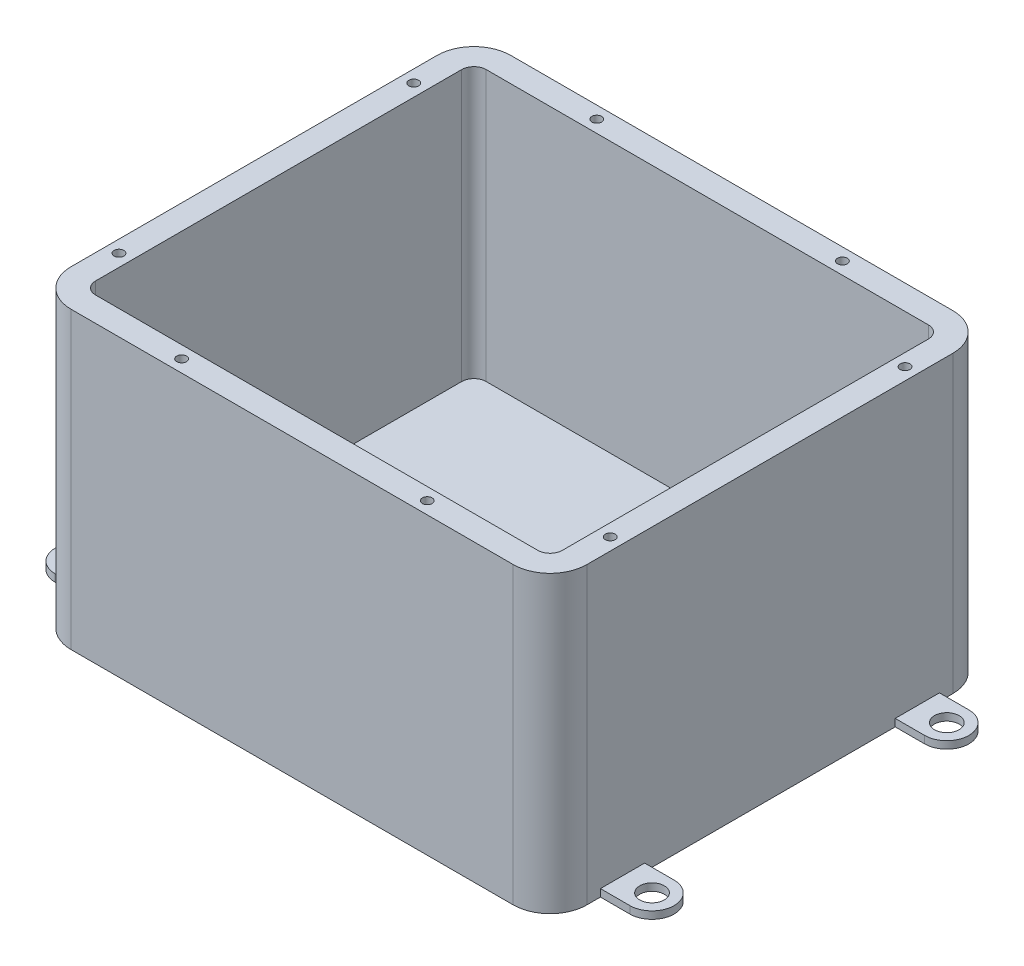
ISO-10303-21;
HEADER;
FILE_DESCRIPTION(('STEP AP214'),'2;1');
FILE_NAME('part.step','',(''),(''),'','','');
FILE_SCHEMA(('AUTOMOTIVE_DESIGN { 1 0 10303 214 1 1 1 1 }'));
ENDSEC;
DATA;
#1=APPLICATION_CONTEXT('core data for automotive mechanical design processes');
#2=APPLICATION_PROTOCOL_DEFINITION('international standard','automotive_design',2000,#1);
#3=PRODUCT_CONTEXT('',#1,'mechanical');
#4=PRODUCT('Part','Part','',(#3));
#5=PRODUCT_RELATED_PRODUCT_CATEGORY('part','',(#4));
#6=PRODUCT_DEFINITION_FORMATION('','',#4);
#7=PRODUCT_DEFINITION_CONTEXT('part definition',#1,'design');
#8=PRODUCT_DEFINITION('design','',#6,#7);
#9=PRODUCT_DEFINITION_SHAPE('','',#8);
#10=(LENGTH_UNIT() NAMED_UNIT(*) SI_UNIT(.MILLI.,.METRE.));
#11=(NAMED_UNIT(*) PLANE_ANGLE_UNIT() SI_UNIT($,.RADIAN.));
#12=(NAMED_UNIT(*) SI_UNIT($,.STERADIAN.) SOLID_ANGLE_UNIT());
#13=UNCERTAINTY_MEASURE_WITH_UNIT(LENGTH_MEASURE(1.E-05),#10,'distance_accuracy_value','');
#14=(GEOMETRIC_REPRESENTATION_CONTEXT(3) GLOBAL_UNCERTAINTY_ASSIGNED_CONTEXT((#13)) GLOBAL_UNIT_ASSIGNED_CONTEXT((#10,
#11,#12)) REPRESENTATION_CONTEXT('',''));
#15=CARTESIAN_POINT('',(0.,0.,0.));
#16=DIRECTION('',(0.,0.,1.));
#17=DIRECTION('',(1.,0.,0.));
#18=AXIS2_PLACEMENT_3D('',#15,#16,#17);
#19=CARTESIAN_POINT('',(-90.,225.,74.5));
#20=DIRECTION('',(0.,-1.,0.));
#21=DIRECTION('',(0.,0.,-1.));
#22=AXIS2_PLACEMENT_3D('',#19,#20,#21);
#23=CYLINDRICAL_SURFACE('',#22,5.);
#24=DIRECTION('',(0.,-1.,0.));
#25=VECTOR('',#24,1.);
#26=CARTESIAN_POINT('',(-95.,225.,74.5));
#27=LINE('',#26,#25);
#28=CARTESIAN_POINT('',(-95.,120.,74.5));
#29=VERTEX_POINT('',#28);
#30=CARTESIAN_POINT('',(-95.,10.,74.5));
#31=VERTEX_POINT('',#30);
#32=EDGE_CURVE('E304',#29,#31,#27,.T.);
#33=ORIENTED_EDGE('',*,*,#32,.F.);
#34=CARTESIAN_POINT('',(-90.,120.,74.5));
#35=DIRECTION('',(0.,1.,0.));
#36=DIRECTION('',(0.,0.,1.));
#37=AXIS2_PLACEMENT_3D('',#34,#35,#36);
#38=CIRCLE('',#37,5.);
#39=CARTESIAN_POINT('',(-90.,120.,79.5));
#40=VERTEX_POINT('',#39);
#41=EDGE_CURVE('E251',#29,#40,#38,.T.);
#42=ORIENTED_EDGE('',*,*,#41,.T.);
#43=DIRECTION('',(0.,1.,0.));
#44=VECTOR('',#43,1.);
#45=CARTESIAN_POINT('',(-90.,225.,79.5));
#46=LINE('',#45,#44);
#47=CARTESIAN_POINT('',(-90.,10.,79.5));
#48=VERTEX_POINT('',#47);
#49=EDGE_CURVE('E297',#40,#48,#46,.F.);
#50=ORIENTED_EDGE('',*,*,#49,.T.);
#51=CARTESIAN_POINT('',(-90.,10.,74.5));
#52=DIRECTION('',(0.,1.,0.));
#53=DIRECTION('',(0.,0.,1.));
#54=AXIS2_PLACEMENT_3D('',#51,#52,#53);
#55=CIRCLE('',#54,5.);
#56=EDGE_CURVE('E306',#31,#48,#55,.T.);
#57=ORIENTED_EDGE('',*,*,#56,.F.);
#58=EDGE_LOOP('',(#33,#42,#50,#57));
#59=FACE_BOUND('',#58,.T.);
#60=ADVANCED_FACE('F37',(#59),#23,.F.);
#61=CARTESIAN_POINT('',(-90.,225.,79.5));
#62=DIRECTION('',(0.,0.,-1.));
#63=DIRECTION('',(-1.,0.,0.));
#64=AXIS2_PLACEMENT_3D('',#61,#62,#63);
#65=PLANE('',#64);
#66=ORIENTED_EDGE('',*,*,#49,.F.);
#67=DIRECTION('',(1.,0.,0.));
#68=VECTOR('',#67,1.);
#69=CARTESIAN_POINT('',(-90.,120.,79.5));
#70=LINE('',#69,#68);
#71=CARTESIAN_POINT('',(90.,120.,79.5));
#72=VERTEX_POINT('',#71);
#73=EDGE_CURVE('E510',#40,#72,#70,.T.);
#74=ORIENTED_EDGE('',*,*,#73,.T.);
#75=DIRECTION('',(0.,-1.,0.));
#76=VECTOR('',#75,1.);
#77=CARTESIAN_POINT('',(90.,225.,79.5));
#78=LINE('',#77,#76);
#79=CARTESIAN_POINT('',(90.,10.,79.5));
#80=VERTEX_POINT('',#79);
#81=EDGE_CURVE('E294',#72,#80,#78,.T.);
#82=ORIENTED_EDGE('',*,*,#81,.T.);
#83=DIRECTION('',(1.,0.,0.));
#84=VECTOR('',#83,1.);
#85=CARTESIAN_POINT('',(-90.,10.,79.5));
#86=LINE('',#85,#84);
#87=EDGE_CURVE('E305',#48,#80,#86,.T.);
#88=ORIENTED_EDGE('',*,*,#87,.F.);
#89=EDGE_LOOP('',(#66,#74,#82,#88));
#90=FACE_BOUND('',#89,.T.);
#91=ADVANCED_FACE('F599',(#90),#65,.T.);
#92=CARTESIAN_POINT('',(90.,225.,74.5));
#93=DIRECTION('',(0.,-1.,0.));
#94=DIRECTION('',(0.,0.,-1.));
#95=AXIS2_PLACEMENT_3D('',#92,#93,#94);
#96=CYLINDRICAL_SURFACE('',#95,5.);
#97=ORIENTED_EDGE('',*,*,#81,.F.);
#98=CARTESIAN_POINT('',(90.,120.,74.5));
#99=DIRECTION('',(0.,1.,0.));
#100=DIRECTION('',(0.,0.,1.));
#101=AXIS2_PLACEMENT_3D('',#98,#99,#100);
#102=CIRCLE('',#101,5.);
#103=CARTESIAN_POINT('',(95.,120.,74.5));
#104=VERTEX_POINT('',#103);
#105=EDGE_CURVE('E509',#72,#104,#102,.T.);
#106=ORIENTED_EDGE('',*,*,#105,.T.);
#107=DIRECTION('',(0.,1.,0.));
#108=VECTOR('',#107,1.);
#109=CARTESIAN_POINT('',(95.,225.,74.5));
#110=LINE('',#109,#108);
#111=CARTESIAN_POINT('',(95.,10.,74.5));
#112=VERTEX_POINT('',#111);
#113=EDGE_CURVE('E289',#104,#112,#110,.F.);
#114=ORIENTED_EDGE('',*,*,#113,.T.);
#115=CARTESIAN_POINT('',(90.,10.,74.5));
#116=DIRECTION('',(0.,1.,0.));
#117=DIRECTION('',(0.,0.,1.));
#118=AXIS2_PLACEMENT_3D('',#115,#116,#117);
#119=CIRCLE('',#118,5.);
#120=EDGE_CURVE('E300',#80,#112,#119,.T.);
#121=ORIENTED_EDGE('',*,*,#120,.F.);
#122=EDGE_LOOP('',(#97,#106,#114,#121));
#123=FACE_BOUND('',#122,.T.);
#124=ADVANCED_FACE('F603',(#123),#96,.F.);
#125=CARTESIAN_POINT('',(95.,225.,74.5));
#126=DIRECTION('',(-1.,0.,0.));
#127=DIRECTION('',(0.,0.,1.));
#128=AXIS2_PLACEMENT_3D('',#125,#126,#127);
#129=PLANE('',#128);
#130=ORIENTED_EDGE('',*,*,#113,.F.);
#131=DIRECTION('',(0.,0.,-1.));
#132=VECTOR('',#131,1.);
#133=CARTESIAN_POINT('',(95.,120.,74.5));
#134=LINE('',#133,#132);
#135=CARTESIAN_POINT('',(95.,120.,-74.5));
#136=VERTEX_POINT('',#135);
#137=EDGE_CURVE('E514',#104,#136,#134,.T.);
#138=ORIENTED_EDGE('',*,*,#137,.T.);
#139=DIRECTION('',(0.,-1.,0.));
#140=VECTOR('',#139,1.);
#141=CARTESIAN_POINT('',(95.,225.,-74.5));
#142=LINE('',#141,#140);
#143=CARTESIAN_POINT('',(95.,10.,-74.5));
#144=VERTEX_POINT('',#143);
#145=EDGE_CURVE('E281',#136,#144,#142,.T.);
#146=ORIENTED_EDGE('',*,*,#145,.T.);
#147=DIRECTION('',(0.,0.,-1.));
#148=VECTOR('',#147,1.);
#149=CARTESIAN_POINT('',(95.,10.,74.5));
#150=LINE('',#149,#148);
#151=EDGE_CURVE('E292',#112,#144,#150,.T.);
#152=ORIENTED_EDGE('',*,*,#151,.F.);
#153=EDGE_LOOP('',(#130,#138,#146,#152));
#154=FACE_BOUND('',#153,.T.);
#155=ADVANCED_FACE('F613',(#154),#129,.T.);
#156=CARTESIAN_POINT('',(90.,225.,-74.5));
#157=DIRECTION('',(0.,-1.,0.));
#158=DIRECTION('',(0.,0.,-1.));
#159=AXIS2_PLACEMENT_3D('',#156,#157,#158);
#160=CYLINDRICAL_SURFACE('',#159,5.);
#161=ORIENTED_EDGE('',*,*,#145,.F.);
#162=CARTESIAN_POINT('',(90.,120.,-74.5));
#163=DIRECTION('',(0.,1.,0.));
#164=DIRECTION('',(0.,0.,1.));
#165=AXIS2_PLACEMENT_3D('',#162,#163,#164);
#166=CIRCLE('',#165,5.);
#167=CARTESIAN_POINT('',(90.,120.,-79.5));
#168=VERTEX_POINT('',#167);
#169=EDGE_CURVE('E517',#136,#168,#166,.T.);
#170=ORIENTED_EDGE('',*,*,#169,.T.);
#171=DIRECTION('',(0.,1.,0.));
#172=VECTOR('',#171,1.);
#173=CARTESIAN_POINT('',(90.,225.,-79.5));
#174=LINE('',#173,#172);
#175=CARTESIAN_POINT('',(90.,10.,-79.5));
#176=VERTEX_POINT('',#175);
#177=EDGE_CURVE('E278',#168,#176,#174,.F.);
#178=ORIENTED_EDGE('',*,*,#177,.T.);
#179=CARTESIAN_POINT('',(90.,10.,-74.5));
#180=DIRECTION('',(0.,1.,0.));
#181=DIRECTION('',(0.,0.,1.));
#182=AXIS2_PLACEMENT_3D('',#179,#180,#181);
#183=CIRCLE('',#182,5.);
#184=EDGE_CURVE('E290',#144,#176,#183,.T.);
#185=ORIENTED_EDGE('',*,*,#184,.F.);
#186=EDGE_LOOP('',(#161,#170,#178,#185));
#187=FACE_BOUND('',#186,.T.);
#188=ADVANCED_FACE('F616',(#187),#160,.F.);
#189=CARTESIAN_POINT('',(-90.,225.,-79.5));
#190=DIRECTION('',(0.,0.,1.));
#191=DIRECTION('',(1.,0.,0.));
#192=AXIS2_PLACEMENT_3D('',#189,#190,#191);
#193=PLANE('',#192);
#194=ORIENTED_EDGE('',*,*,#177,.F.);
#195=DIRECTION('',(-1.,0.,0.));
#196=VECTOR('',#195,1.);
#197=CARTESIAN_POINT('',(-90.,120.,-79.5));
#198=LINE('',#197,#196);
#199=CARTESIAN_POINT('',(-90.,120.,-79.5));
#200=VERTEX_POINT('',#199);
#201=EDGE_CURVE('E265',#168,#200,#198,.T.);
#202=ORIENTED_EDGE('',*,*,#201,.T.);
#203=DIRECTION('',(0.,-1.,0.));
#204=VECTOR('',#203,1.);
#205=CARTESIAN_POINT('',(-90.,225.,-79.5));
#206=LINE('',#205,#204);
#207=CARTESIAN_POINT('',(-90.,10.,-79.5));
#208=VERTEX_POINT('',#207);
#209=EDGE_CURVE('E262',#200,#208,#206,.T.);
#210=ORIENTED_EDGE('',*,*,#209,.T.);
#211=DIRECTION('',(-1.,0.,0.));
#212=VECTOR('',#211,1.);
#213=CARTESIAN_POINT('',(-90.,10.,-79.5));
#214=LINE('',#213,#212);
#215=EDGE_CURVE('E284',#176,#208,#214,.T.);
#216=ORIENTED_EDGE('',*,*,#215,.F.);
#217=EDGE_LOOP('',(#194,#202,#210,#216));
#218=FACE_BOUND('',#217,.T.);
#219=ADVANCED_FACE('F625',(#218),#193,.T.);
#220=CARTESIAN_POINT('',(-90.,225.,-74.5));
#221=DIRECTION('',(0.,-1.,0.));
#222=DIRECTION('',(0.,0.,-1.));
#223=AXIS2_PLACEMENT_3D('',#220,#221,#222);
#224=CYLINDRICAL_SURFACE('',#223,5.);
#225=ORIENTED_EDGE('',*,*,#209,.F.);
#226=CARTESIAN_POINT('',(-90.,120.,-74.5));
#227=DIRECTION('',(0.,1.,0.));
#228=DIRECTION('',(0.,0.,1.));
#229=AXIS2_PLACEMENT_3D('',#226,#227,#228);
#230=CIRCLE('',#229,5.);
#231=CARTESIAN_POINT('',(-95.,120.,-74.5));
#232=VERTEX_POINT('',#231);
#233=EDGE_CURVE('E252',#200,#232,#230,.T.);
#234=ORIENTED_EDGE('',*,*,#233,.T.);
#235=DIRECTION('',(0.,1.,0.));
#236=VECTOR('',#235,1.);
#237=CARTESIAN_POINT('',(-95.,225.,-74.5));
#238=LINE('',#237,#236);
#239=CARTESIAN_POINT('',(-95.,10.,-74.5));
#240=VERTEX_POINT('',#239);
#241=EDGE_CURVE('E48',#232,#240,#238,.F.);
#242=ORIENTED_EDGE('',*,*,#241,.T.);
#243=CARTESIAN_POINT('',(-90.,10.,-74.5));
#244=DIRECTION('',(0.,1.,0.));
#245=DIRECTION('',(0.,0.,1.));
#246=AXIS2_PLACEMENT_3D('',#243,#244,#245);
#247=CIRCLE('',#246,5.);
#248=EDGE_CURVE('E279',#208,#240,#247,.T.);
#249=ORIENTED_EDGE('',*,*,#248,.F.);
#250=EDGE_LOOP('',(#225,#234,#242,#249));
#251=FACE_BOUND('',#250,.T.);
#252=ADVANCED_FACE('F258',(#251),#224,.F.);
#253=CARTESIAN_POINT('',(-95.,225.,74.5));
#254=DIRECTION('',(1.,0.,0.));
#255=DIRECTION('',(0.,0.,-1.));
#256=AXIS2_PLACEMENT_3D('',#253,#254,#255);
#257=PLANE('',#256);
#258=ORIENTED_EDGE('',*,*,#241,.F.);
#259=DIRECTION('',(0.,0.,1.));
#260=VECTOR('',#259,1.);
#261=CARTESIAN_POINT('',(-95.,120.,74.5));
#262=LINE('',#261,#260);
#263=EDGE_CURVE('E12',#232,#29,#262,.T.);
#264=ORIENTED_EDGE('',*,*,#263,.T.);
#265=ORIENTED_EDGE('',*,*,#32,.T.);
#266=DIRECTION('',(0.,0.,1.));
#267=VECTOR('',#266,1.);
#268=CARTESIAN_POINT('',(-95.,10.,74.5));
#269=LINE('',#268,#267);
#270=EDGE_CURVE('E269',#240,#31,#269,.T.);
#271=ORIENTED_EDGE('',*,*,#270,.F.);
#272=EDGE_LOOP('',(#258,#264,#265,#271));
#273=FACE_BOUND('',#272,.T.);
#274=ADVANCED_FACE('F267',(#273),#257,.T.);
#275=CARTESIAN_POINT('',(-90.,10.,74.5));
#276=DIRECTION('',(0.,1.,0.));
#277=DIRECTION('',(0.,0.,1.));
#278=AXIS2_PLACEMENT_3D('',#275,#276,#277);
#279=PLANE('',#278);
#280=ORIENTED_EDGE('',*,*,#56,.T.);
#281=ORIENTED_EDGE('',*,*,#87,.T.);
#282=ORIENTED_EDGE('',*,*,#120,.T.);
#283=ORIENTED_EDGE('',*,*,#151,.T.);
#284=ORIENTED_EDGE('',*,*,#184,.T.);
#285=ORIENTED_EDGE('',*,*,#215,.T.);
#286=ORIENTED_EDGE('',*,*,#248,.T.);
#287=ORIENTED_EDGE('',*,*,#270,.T.);
#288=EDGE_LOOP('',(#280,#281,#282,#283,#284,#285,#286,#287));
#289=FACE_BOUND('',#288,.T.);
#290=ADVANCED_FACE('F45',(#289),#279,.T.);
#291=CARTESIAN_POINT('',(0.,120.,0.));
#292=DIRECTION('',(0.,1.,0.));
#293=DIRECTION('',(0.,0.,1.));
#294=AXIS2_PLACEMENT_3D('',#291,#292,#293);
#295=PLANE('',#294);
#296=CARTESIAN_POINT('',(-100.,120.,-60.));
#297=DIRECTION('',(0.,1.,0.));
#298=DIRECTION('',(0.,0.,1.));
#299=AXIS2_PLACEMENT_3D('',#296,#297,#298);
#300=CIRCLE('',#299,2.);
#301=CARTESIAN_POINT('',(-100.,120.,-58.));
#302=VERTEX_POINT('',#301);
#303=EDGE_CURVE('E543',#302,#302,#300,.T.);
#304=ORIENTED_EDGE('',*,*,#303,.F.);
#305=EDGE_LOOP('',(#304));
#306=FACE_BOUND('',#305,.T.);
#307=CARTESIAN_POINT('',(50.,120.,84.5));
#308=DIRECTION('',(0.,1.,0.));
#309=DIRECTION('',(0.,0.,1.));
#310=AXIS2_PLACEMENT_3D('',#307,#308,#309);
#311=CIRCLE('',#310,2.);
#312=CARTESIAN_POINT('',(50.,120.,86.5));
#313=VERTEX_POINT('',#312);
#314=EDGE_CURVE('E529',#313,#313,#311,.T.);
#315=ORIENTED_EDGE('',*,*,#314,.F.);
#316=EDGE_LOOP('',(#315));
#317=FACE_BOUND('',#316,.T.);
#318=CARTESIAN_POINT('',(-50.,120.,84.5));
#319=DIRECTION('',(0.,1.,0.));
#320=DIRECTION('',(0.,0.,-1.));
#321=AXIS2_PLACEMENT_3D('',#318,#319,#320);
#322=CIRCLE('',#321,2.);
#323=CARTESIAN_POINT('',(-50.,120.,82.5));
#324=VERTEX_POINT('',#323);
#325=EDGE_CURVE('E528',#324,#324,#322,.T.);
#326=ORIENTED_EDGE('',*,*,#325,.F.);
#327=EDGE_LOOP('',(#326));
#328=FACE_BOUND('',#327,.T.);
#329=CARTESIAN_POINT('',(50.,120.,-84.5));
#330=DIRECTION('',(0.,1.,0.));
#331=DIRECTION('',(0.,0.,-1.));
#332=AXIS2_PLACEMENT_3D('',#329,#330,#331);
#333=CIRCLE('',#332,2.);
#334=CARTESIAN_POINT('',(50.,120.,-86.5));
#335=VERTEX_POINT('',#334);
#336=EDGE_CURVE('E522',#335,#335,#333,.T.);
#337=ORIENTED_EDGE('',*,*,#336,.F.);
#338=EDGE_LOOP('',(#337));
#339=FACE_BOUND('',#338,.T.);
#340=CARTESIAN_POINT('',(-100.,120.,60.));
#341=DIRECTION('',(0.,1.,0.));
#342=DIRECTION('',(0.,0.,-1.));
#343=AXIS2_PLACEMENT_3D('',#340,#341,#342);
#344=CIRCLE('',#343,2.);
#345=CARTESIAN_POINT('',(-100.,120.,58.));
#346=VERTEX_POINT('',#345);
#347=EDGE_CURVE('E544',#346,#346,#344,.T.);
#348=ORIENTED_EDGE('',*,*,#347,.F.);
#349=EDGE_LOOP('',(#348));
#350=FACE_BOUND('',#349,.T.);
#351=CARTESIAN_POINT('',(100.,120.,60.));
#352=DIRECTION('',(0.,1.,0.));
#353=DIRECTION('',(0.,0.,1.));
#354=AXIS2_PLACEMENT_3D('',#351,#352,#353);
#355=CIRCLE('',#354,2.);
#356=CARTESIAN_POINT('',(100.,120.,62.));
#357=VERTEX_POINT('',#356);
#358=EDGE_CURVE('E559',#357,#357,#355,.T.);
#359=ORIENTED_EDGE('',*,*,#358,.F.);
#360=EDGE_LOOP('',(#359));
#361=FACE_BOUND('',#360,.T.);
#362=CARTESIAN_POINT('',(100.,120.,-60.));
#363=DIRECTION('',(0.,1.,0.));
#364=DIRECTION('',(0.,0.,-1.));
#365=AXIS2_PLACEMENT_3D('',#362,#363,#364);
#366=CIRCLE('',#365,2.);
#367=CARTESIAN_POINT('',(100.,120.,-62.));
#368=VERTEX_POINT('',#367);
#369=EDGE_CURVE('E551',#368,#368,#366,.T.);
#370=ORIENTED_EDGE('',*,*,#369,.F.);
#371=EDGE_LOOP('',(#370));
#372=FACE_BOUND('',#371,.T.);
#373=CARTESIAN_POINT('',(-50.,120.,-84.5));
#374=DIRECTION('',(0.,1.,0.));
#375=DIRECTION('',(0.,0.,1.));
#376=AXIS2_PLACEMENT_3D('',#373,#374,#375);
#377=CIRCLE('',#376,2.);
#378=CARTESIAN_POINT('',(-50.,120.,-82.5));
#379=VERTEX_POINT('',#378);
#380=EDGE_CURVE('E518',#379,#379,#377,.T.);
#381=ORIENTED_EDGE('',*,*,#380,.F.);
#382=EDGE_LOOP('',(#381));
#383=FACE_BOUND('',#382,.T.);
#384=ORIENTED_EDGE('',*,*,#41,.F.);
#385=ORIENTED_EDGE('',*,*,#263,.F.);
#386=ORIENTED_EDGE('',*,*,#233,.F.);
#387=ORIENTED_EDGE('',*,*,#201,.F.);
#388=ORIENTED_EDGE('',*,*,#169,.F.);
#389=ORIENTED_EDGE('',*,*,#137,.F.);
#390=ORIENTED_EDGE('',*,*,#105,.F.);
#391=ORIENTED_EDGE('',*,*,#73,.F.);
#392=EDGE_LOOP('',(#384,#385,#386,#387,#388,#389,#390,#391));
#393=FACE_BOUND('',#392,.T.);
#394=DIRECTION('',(0.,0.,1.));
#395=VECTOR('',#394,1.);
#396=CARTESIAN_POINT('',(-105.,120.,74.5));
#397=LINE('',#396,#395);
#398=CARTESIAN_POINT('',(-105.,120.,-74.5));
#399=VERTEX_POINT('',#398);
#400=CARTESIAN_POINT('',(-105.,120.,74.5));
#401=VERTEX_POINT('',#400);
#402=EDGE_CURVE('E494',#399,#401,#397,.T.);
#403=ORIENTED_EDGE('',*,*,#402,.T.);
#404=CARTESIAN_POINT('',(-90.,120.,74.5));
#405=DIRECTION('',(0.,1.,0.));
#406=DIRECTION('',(0.,0.,1.));
#407=AXIS2_PLACEMENT_3D('',#404,#405,#406);
#408=CIRCLE('',#407,15.);
#409=CARTESIAN_POINT('',(-90.,120.,89.5));
#410=VERTEX_POINT('',#409);
#411=EDGE_CURVE('E54',#401,#410,#408,.T.);
#412=ORIENTED_EDGE('',*,*,#411,.T.);
#413=DIRECTION('',(1.,0.,0.));
#414=VECTOR('',#413,1.);
#415=CARTESIAN_POINT('',(-90.,120.,89.5));
#416=LINE('',#415,#414);
#417=CARTESIAN_POINT('',(90.,120.,89.5));
#418=VERTEX_POINT('',#417);
#419=EDGE_CURVE('E64',#410,#418,#416,.T.);
#420=ORIENTED_EDGE('',*,*,#419,.T.);
#421=CARTESIAN_POINT('',(90.,120.,74.5));
#422=DIRECTION('',(0.,1.,0.));
#423=DIRECTION('',(0.,0.,1.));
#424=AXIS2_PLACEMENT_3D('',#421,#422,#423);
#425=CIRCLE('',#424,15.);
#426=CARTESIAN_POINT('',(105.,120.,74.5));
#427=VERTEX_POINT('',#426);
#428=EDGE_CURVE('E486',#418,#427,#425,.T.);
#429=ORIENTED_EDGE('',*,*,#428,.T.);
#430=DIRECTION('',(0.,0.,-1.));
#431=VECTOR('',#430,1.);
#432=CARTESIAN_POINT('',(105.,120.,74.5));
#433=LINE('',#432,#431);
#434=CARTESIAN_POINT('',(105.,120.,-74.5));
#435=VERTEX_POINT('',#434);
#436=EDGE_CURVE('E493',#427,#435,#433,.T.);
#437=ORIENTED_EDGE('',*,*,#436,.T.);
#438=CARTESIAN_POINT('',(90.,120.,-74.5));
#439=DIRECTION('',(0.,1.,0.));
#440=DIRECTION('',(0.,0.,1.));
#441=AXIS2_PLACEMENT_3D('',#438,#439,#440);
#442=CIRCLE('',#441,15.);
#443=CARTESIAN_POINT('',(90.,120.,-89.5));
#444=VERTEX_POINT('',#443);
#445=EDGE_CURVE('E500',#435,#444,#442,.T.);
#446=ORIENTED_EDGE('',*,*,#445,.T.);
#447=DIRECTION('',(-1.,0.,0.));
#448=VECTOR('',#447,1.);
#449=CARTESIAN_POINT('',(-90.,120.,-89.5));
#450=LINE('',#449,#448);
#451=CARTESIAN_POINT('',(-90.,120.,-89.5));
#452=VERTEX_POINT('',#451);
#453=EDGE_CURVE('E499',#444,#452,#450,.T.);
#454=ORIENTED_EDGE('',*,*,#453,.T.);
#455=CARTESIAN_POINT('',(-90.,120.,-74.5));
#456=DIRECTION('',(0.,1.,0.));
#457=DIRECTION('',(0.,0.,1.));
#458=AXIS2_PLACEMENT_3D('',#455,#456,#457);
#459=CIRCLE('',#458,15.);
#460=EDGE_CURVE('E503',#452,#399,#459,.T.);
#461=ORIENTED_EDGE('',*,*,#460,.T.);
#462=EDGE_LOOP('',(#403,#412,#420,#429,#437,#446,#454,#461));
#463=FACE_BOUND('',#462,.T.);
#464=ADVANCED_FACE('F248',(#306,#317,#328,#339,#350,#361,#372,#383,#393,#463),#295,.T.);
#465=CARTESIAN_POINT('',(105.,225.,74.5));
#466=DIRECTION('',(-1.,0.,0.));
#467=DIRECTION('',(0.,0.,1.));
#468=AXIS2_PLACEMENT_3D('',#465,#466,#467);
#469=PLANE('',#468);
#470=ORIENTED_EDGE('',*,*,#436,.F.);
#471=DIRECTION('',(0.,-1.,0.));
#472=VECTOR('',#471,1.);
#473=CARTESIAN_POINT('',(105.,225.,74.5));
#474=LINE('',#473,#472);
#475=CARTESIAN_POINT('',(105.,0.,74.5));
#476=VERTEX_POINT('',#475);
#477=EDGE_CURVE('E312',#427,#476,#474,.T.);
#478=ORIENTED_EDGE('',*,*,#477,.T.);
#479=DIRECTION('',(0.,0.,-1.));
#480=VECTOR('',#479,1.);
#481=CARTESIAN_POINT('',(105.,0.,74.5));
#482=LINE('',#481,#480);
#483=CARTESIAN_POINT('',(105.,0.,69.));
#484=VERTEX_POINT('',#483);
#485=EDGE_CURVE('E345',#476,#484,#482,.T.);
#486=ORIENTED_EDGE('',*,*,#485,.T.);
#487=DIRECTION('',(0.,-1.,0.));
#488=VECTOR('',#487,1.);
#489=CARTESIAN_POINT('',(105.,3.,69.));
#490=LINE('',#489,#488);
#491=CARTESIAN_POINT('',(105.,3.,69.));
#492=VERTEX_POINT('',#491);
#493=EDGE_CURVE('E449',#492,#484,#490,.T.);
#494=ORIENTED_EDGE('',*,*,#493,.F.);
#495=DIRECTION('',(0.,0.,1.));
#496=VECTOR('',#495,1.);
#497=CARTESIAN_POINT('',(105.,3.,51.));
#498=LINE('',#497,#496);
#499=CARTESIAN_POINT('',(105.,3.,51.));
#500=VERTEX_POINT('',#499);
#501=EDGE_CURVE('E436',#500,#492,#498,.T.);
#502=ORIENTED_EDGE('',*,*,#501,.F.);
#503=DIRECTION('',(0.,-1.,0.));
#504=VECTOR('',#503,1.);
#505=CARTESIAN_POINT('',(105.,3.,51.));
#506=LINE('',#505,#504);
#507=CARTESIAN_POINT('',(105.,0.,51.));
#508=VERTEX_POINT('',#507);
#509=EDGE_CURVE('E448',#500,#508,#506,.T.);
#510=ORIENTED_EDGE('',*,*,#509,.T.);
#511=CARTESIAN_POINT('',(105.,0.,-51.));
#512=VERTEX_POINT('',#511);
#513=EDGE_CURVE('E343',#508,#512,#482,.T.);
#514=ORIENTED_EDGE('',*,*,#513,.T.);
#515=DIRECTION('',(0.,-1.,0.));
#516=VECTOR('',#515,1.);
#517=CARTESIAN_POINT('',(105.,3.,-51.));
#518=LINE('',#517,#516);
#519=CARTESIAN_POINT('',(105.,3.,-51.));
#520=VERTEX_POINT('',#519);
#521=EDGE_CURVE('E415',#520,#512,#518,.T.);
#522=ORIENTED_EDGE('',*,*,#521,.F.);
#523=DIRECTION('',(0.,0.,1.));
#524=VECTOR('',#523,1.);
#525=CARTESIAN_POINT('',(105.,3.,-51.));
#526=LINE('',#525,#524);
#527=CARTESIAN_POINT('',(105.,3.,-69.));
#528=VERTEX_POINT('',#527);
#529=EDGE_CURVE('E405',#528,#520,#526,.T.);
#530=ORIENTED_EDGE('',*,*,#529,.F.);
#531=DIRECTION('',(0.,-1.,0.));
#532=VECTOR('',#531,1.);
#533=CARTESIAN_POINT('',(105.,3.,-69.));
#534=LINE('',#533,#532);
#535=CARTESIAN_POINT('',(105.,0.,-69.));
#536=VERTEX_POINT('',#535);
#537=EDGE_CURVE('E416',#528,#536,#534,.T.);
#538=ORIENTED_EDGE('',*,*,#537,.T.);
#539=CARTESIAN_POINT('',(105.,0.,-74.5));
#540=VERTEX_POINT('',#539);
#541=EDGE_CURVE('E348',#536,#540,#482,.T.);
#542=ORIENTED_EDGE('',*,*,#541,.T.);
#543=DIRECTION('',(0.,-1.,0.));
#544=VECTOR('',#543,1.);
#545=CARTESIAN_POINT('',(105.,225.,-74.5));
#546=LINE('',#545,#544);
#547=EDGE_CURVE('E317',#435,#540,#546,.T.);
#548=ORIENTED_EDGE('',*,*,#547,.F.);
#549=EDGE_LOOP('',(#470,#478,#486,#494,#502,#510,#514,#522,#530,#538,#542,#548));
#550=FACE_BOUND('',#549,.T.);
#551=ADVANCED_FACE('F575',(#550),#469,.F.);
#552=CARTESIAN_POINT('',(-105.,225.,74.5));
#553=DIRECTION('',(1.,0.,0.));
#554=DIRECTION('',(0.,0.,-1.));
#555=AXIS2_PLACEMENT_3D('',#552,#553,#554);
#556=PLANE('',#555);
#557=ORIENTED_EDGE('',*,*,#402,.F.);
#558=DIRECTION('',(0.,-1.,0.));
#559=VECTOR('',#558,1.);
#560=CARTESIAN_POINT('',(-105.,225.,-74.5));
#561=LINE('',#560,#559);
#562=CARTESIAN_POINT('',(-105.,0.,-74.5));
#563=VERTEX_POINT('',#562);
#564=EDGE_CURVE('E321',#399,#563,#561,.T.);
#565=ORIENTED_EDGE('',*,*,#564,.T.);
#566=DIRECTION('',(0.,0.,1.));
#567=VECTOR('',#566,1.);
#568=CARTESIAN_POINT('',(-105.,0.,74.5));
#569=LINE('',#568,#567);
#570=CARTESIAN_POINT('',(-105.,0.,-69.));
#571=VERTEX_POINT('',#570);
#572=EDGE_CURVE('E327',#563,#571,#569,.T.);
#573=ORIENTED_EDGE('',*,*,#572,.T.);
#574=DIRECTION('',(0.,-1.,0.));
#575=VECTOR('',#574,1.);
#576=CARTESIAN_POINT('',(-105.,3.,-69.));
#577=LINE('',#576,#575);
#578=CARTESIAN_POINT('',(-105.,3.,-69.));
#579=VERTEX_POINT('',#578);
#580=EDGE_CURVE('E359',#579,#571,#577,.T.);
#581=ORIENTED_EDGE('',*,*,#580,.F.);
#582=DIRECTION('',(0.,0.,-1.));
#583=VECTOR('',#582,1.);
#584=CARTESIAN_POINT('',(-105.,3.,-51.));
#585=LINE('',#584,#583);
#586=CARTESIAN_POINT('',(-105.,3.,-51.));
#587=VERTEX_POINT('',#586);
#588=EDGE_CURVE('E376',#587,#579,#585,.T.);
#589=ORIENTED_EDGE('',*,*,#588,.F.);
#590=DIRECTION('',(0.,-1.,0.));
#591=VECTOR('',#590,1.);
#592=CARTESIAN_POINT('',(-105.,3.,-51.));
#593=LINE('',#592,#591);
#594=CARTESIAN_POINT('',(-105.,0.,-51.));
#595=VERTEX_POINT('',#594);
#596=EDGE_CURVE('E357',#587,#595,#593,.T.);
#597=ORIENTED_EDGE('',*,*,#596,.T.);
#598=CARTESIAN_POINT('',(-105.,0.,51.));
#599=VERTEX_POINT('',#598);
#600=EDGE_CURVE('E331',#595,#599,#569,.T.);
#601=ORIENTED_EDGE('',*,*,#600,.T.);
#602=DIRECTION('',(0.,-1.,0.));
#603=VECTOR('',#602,1.);
#604=CARTESIAN_POINT('',(-105.,3.,51.));
#605=LINE('',#604,#603);
#606=CARTESIAN_POINT('',(-105.,3.,51.));
#607=VERTEX_POINT('',#606);
#608=EDGE_CURVE('E480',#607,#599,#605,.T.);
#609=ORIENTED_EDGE('',*,*,#608,.F.);
#610=DIRECTION('',(0.,0.,-1.));
#611=VECTOR('',#610,1.);
#612=CARTESIAN_POINT('',(-105.,3.,51.));
#613=LINE('',#612,#611);
#614=CARTESIAN_POINT('',(-105.,3.,69.));
#615=VERTEX_POINT('',#614);
#616=EDGE_CURVE('E470',#615,#607,#613,.T.);
#617=ORIENTED_EDGE('',*,*,#616,.F.);
#618=DIRECTION('',(0.,-1.,0.));
#619=VECTOR('',#618,1.);
#620=CARTESIAN_POINT('',(-105.,3.,69.));
#621=LINE('',#620,#619);
#622=CARTESIAN_POINT('',(-105.,0.,69.));
#623=VERTEX_POINT('',#622);
#624=EDGE_CURVE('E481',#615,#623,#621,.T.);
#625=ORIENTED_EDGE('',*,*,#624,.T.);
#626=CARTESIAN_POINT('',(-105.,0.,74.5));
#627=VERTEX_POINT('',#626);
#628=EDGE_CURVE('E335',#623,#627,#569,.T.);
#629=ORIENTED_EDGE('',*,*,#628,.T.);
#630=DIRECTION('',(0.,-1.,0.));
#631=VECTOR('',#630,1.);
#632=CARTESIAN_POINT('',(-105.,225.,74.5));
#633=LINE('',#632,#631);
#634=EDGE_CURVE('E328',#401,#627,#633,.T.);
#635=ORIENTED_EDGE('',*,*,#634,.F.);
#636=EDGE_LOOP('',(#557,#565,#573,#581,#589,#597,#601,#609,#617,#625,#629,#635));
#637=FACE_BOUND('',#636,.T.);
#638=ADVANCED_FACE('F913',(#637),#556,.F.);
#639=CARTESIAN_POINT('',(-90.,225.,74.5));
#640=DIRECTION('',(0.,-1.,0.));
#641=DIRECTION('',(0.,0.,-1.));
#642=AXIS2_PLACEMENT_3D('',#639,#640,#641);
#643=CYLINDRICAL_SURFACE('',#642,15.);
#644=ORIENTED_EDGE('',*,*,#411,.F.);
#645=ORIENTED_EDGE('',*,*,#634,.T.);
#646=CARTESIAN_POINT('',(-90.,0.,74.5));
#647=DIRECTION('',(0.,1.,0.));
#648=DIRECTION('',(0.,0.,1.));
#649=AXIS2_PLACEMENT_3D('',#646,#647,#648);
#650=CIRCLE('',#649,15.);
#651=CARTESIAN_POINT('',(-90.,0.,89.5));
#652=VERTEX_POINT('',#651);
#653=EDGE_CURVE('E351',#627,#652,#650,.T.);
#654=ORIENTED_EDGE('',*,*,#653,.T.);
#655=DIRECTION('',(0.,-1.,0.));
#656=VECTOR('',#655,1.);
#657=CARTESIAN_POINT('',(-90.,225.,89.5));
#658=LINE('',#657,#656);
#659=EDGE_CURVE('E274',#410,#652,#658,.T.);
#660=ORIENTED_EDGE('',*,*,#659,.F.);
#661=EDGE_LOOP('',(#644,#645,#654,#660));
#662=FACE_BOUND('',#661,.T.);
#663=ADVANCED_FACE('F610',(#662),#643,.T.);
#664=CARTESIAN_POINT('',(-90.,225.,89.5));
#665=DIRECTION('',(0.,0.,-1.));
#666=DIRECTION('',(-1.,0.,0.));
#667=AXIS2_PLACEMENT_3D('',#664,#665,#666);
#668=PLANE('',#667);
#669=ORIENTED_EDGE('',*,*,#419,.F.);
#670=ORIENTED_EDGE('',*,*,#659,.T.);
#671=DIRECTION('',(1.,0.,0.));
#672=VECTOR('',#671,1.);
#673=CARTESIAN_POINT('',(-90.,0.,89.5));
#674=LINE('',#673,#672);
#675=CARTESIAN_POINT('',(90.,0.,89.5));
#676=VERTEX_POINT('',#675);
#677=EDGE_CURVE('E350',#652,#676,#674,.T.);
#678=ORIENTED_EDGE('',*,*,#677,.T.);
#679=DIRECTION('',(0.,-1.,0.));
#680=VECTOR('',#679,1.);
#681=CARTESIAN_POINT('',(90.,225.,89.5));
#682=LINE('',#681,#680);
#683=EDGE_CURVE('E309',#418,#676,#682,.T.);
#684=ORIENTED_EDGE('',*,*,#683,.F.);
#685=EDGE_LOOP('',(#669,#670,#678,#684));
#686=FACE_BOUND('',#685,.T.);
#687=ADVANCED_FACE('F900',(#686),#668,.F.);
#688=CARTESIAN_POINT('',(90.,225.,74.5));
#689=DIRECTION('',(0.,-1.,0.));
#690=DIRECTION('',(0.,0.,-1.));
#691=AXIS2_PLACEMENT_3D('',#688,#689,#690);
#692=CYLINDRICAL_SURFACE('',#691,15.);
#693=ORIENTED_EDGE('',*,*,#428,.F.);
#694=ORIENTED_EDGE('',*,*,#683,.T.);
#695=CARTESIAN_POINT('',(90.,0.,74.5));
#696=DIRECTION('',(0.,1.,0.));
#697=DIRECTION('',(0.,0.,1.));
#698=AXIS2_PLACEMENT_3D('',#695,#696,#697);
#699=CIRCLE('',#698,15.);
#700=EDGE_CURVE('E349',#676,#476,#699,.T.);
#701=ORIENTED_EDGE('',*,*,#700,.T.);
#702=ORIENTED_EDGE('',*,*,#477,.F.);
#703=EDGE_LOOP('',(#693,#694,#701,#702));
#704=FACE_BOUND('',#703,.T.);
#705=ADVANCED_FACE('F888',(#704),#692,.T.);
#706=CARTESIAN_POINT('',(90.,225.,-74.5));
#707=DIRECTION('',(0.,-1.,0.));
#708=DIRECTION('',(0.,0.,-1.));
#709=AXIS2_PLACEMENT_3D('',#706,#707,#708);
#710=CYLINDRICAL_SURFACE('',#709,15.);
#711=ORIENTED_EDGE('',*,*,#445,.F.);
#712=ORIENTED_EDGE('',*,*,#547,.T.);
#713=CARTESIAN_POINT('',(90.,0.,-74.5));
#714=DIRECTION('',(0.,1.,0.));
#715=DIRECTION('',(0.,0.,1.));
#716=AXIS2_PLACEMENT_3D('',#713,#714,#715);
#717=CIRCLE('',#716,15.);
#718=CARTESIAN_POINT('',(90.,0.,-89.5));
#719=VERTEX_POINT('',#718);
#720=EDGE_CURVE('E339',#540,#719,#717,.T.);
#721=ORIENTED_EDGE('',*,*,#720,.T.);
#722=DIRECTION('',(0.,-1.,0.));
#723=VECTOR('',#722,1.);
#724=CARTESIAN_POINT('',(90.,225.,-89.5));
#725=LINE('',#724,#723);
#726=EDGE_CURVE('E318',#444,#719,#725,.T.);
#727=ORIENTED_EDGE('',*,*,#726,.F.);
#728=EDGE_LOOP('',(#711,#712,#721,#727));
#729=FACE_BOUND('',#728,.T.);
#730=ADVANCED_FACE('F880',(#729),#710,.T.);
#731=CARTESIAN_POINT('',(-90.,225.,-89.5));
#732=DIRECTION('',(0.,0.,1.));
#733=DIRECTION('',(1.,0.,0.));
#734=AXIS2_PLACEMENT_3D('',#731,#732,#733);
#735=PLANE('',#734);
#736=ORIENTED_EDGE('',*,*,#453,.F.);
#737=ORIENTED_EDGE('',*,*,#726,.T.);
#738=DIRECTION('',(-1.,0.,0.));
#739=VECTOR('',#738,1.);
#740=CARTESIAN_POINT('',(-90.,0.,-89.5));
#741=LINE('',#740,#739);
#742=CARTESIAN_POINT('',(-90.,0.,-89.5));
#743=VERTEX_POINT('',#742);
#744=EDGE_CURVE('E337',#719,#743,#741,.T.);
#745=ORIENTED_EDGE('',*,*,#744,.T.);
#746=DIRECTION('',(0.,-1.,0.));
#747=VECTOR('',#746,1.);
#748=CARTESIAN_POINT('',(-90.,225.,-89.5));
#749=LINE('',#748,#747);
#750=EDGE_CURVE('E325',#452,#743,#749,.T.);
#751=ORIENTED_EDGE('',*,*,#750,.F.);
#752=EDGE_LOOP('',(#736,#737,#745,#751));
#753=FACE_BOUND('',#752,.T.);
#754=ADVANCED_FACE('F866',(#753),#735,.F.);
#755=CARTESIAN_POINT('',(-90.,225.,-74.5));
#756=DIRECTION('',(0.,-1.,0.));
#757=DIRECTION('',(0.,0.,-1.));
#758=AXIS2_PLACEMENT_3D('',#755,#756,#757);
#759=CYLINDRICAL_SURFACE('',#758,15.);
#760=ORIENTED_EDGE('',*,*,#460,.F.);
#761=ORIENTED_EDGE('',*,*,#750,.T.);
#762=CARTESIAN_POINT('',(-90.,0.,-74.5));
#763=DIRECTION('',(0.,1.,0.));
#764=DIRECTION('',(0.,0.,-1.));
#765=AXIS2_PLACEMENT_3D('',#762,#763,#764);
#766=CIRCLE('',#765,15.);
#767=EDGE_CURVE('E332',#743,#563,#766,.T.);
#768=ORIENTED_EDGE('',*,*,#767,.T.);
#769=ORIENTED_EDGE('',*,*,#564,.F.);
#770=EDGE_LOOP('',(#760,#761,#768,#769));
#771=FACE_BOUND('',#770,.T.);
#772=ADVANCED_FACE('F647',(#771),#759,.T.);
#773=CARTESIAN_POINT('',(-90.,0.,74.5));
#774=DIRECTION('',(0.,1.,0.));
#775=DIRECTION('',(0.,0.,1.));
#776=AXIS2_PLACEMENT_3D('',#773,#774,#775);
#777=PLANE('',#776);
#778=ORIENTED_EDGE('',*,*,#653,.F.);
#779=ORIENTED_EDGE('',*,*,#628,.F.);
#780=DIRECTION('',(1.,0.,0.));
#781=VECTOR('',#780,1.);
#782=CARTESIAN_POINT('',(-105.,0.,69.));
#783=LINE('',#782,#781);
#784=CARTESIAN_POINT('',(-117.,0.,69.));
#785=VERTEX_POINT('',#784);
#786=EDGE_CURVE('E471',#785,#623,#783,.T.);
#787=ORIENTED_EDGE('',*,*,#786,.F.);
#788=CARTESIAN_POINT('',(-117.,0.,60.));
#789=DIRECTION('',(0.,1.,0.));
#790=DIRECTION('',(0.,0.,-1.));
#791=AXIS2_PLACEMENT_3D('',#788,#789,#790);
#792=CIRCLE('',#791,9.);
#793=CARTESIAN_POINT('',(-117.,0.,51.));
#794=VERTEX_POINT('',#793);
#795=EDGE_CURVE('E457',#794,#785,#792,.T.);
#796=ORIENTED_EDGE('',*,*,#795,.F.);
#797=DIRECTION('',(-1.,0.,0.));
#798=VECTOR('',#797,1.);
#799=CARTESIAN_POINT('',(-117.,0.,51.));
#800=LINE('',#799,#798);
#801=EDGE_CURVE('E463',#599,#794,#800,.T.);
#802=ORIENTED_EDGE('',*,*,#801,.F.);
#803=ORIENTED_EDGE('',*,*,#600,.F.);
#804=DIRECTION('',(1.,0.,0.));
#805=VECTOR('',#804,1.);
#806=CARTESIAN_POINT('',(-117.,0.,-51.));
#807=LINE('',#806,#805);
#808=CARTESIAN_POINT('',(-117.,0.,-51.));
#809=VERTEX_POINT('',#808);
#810=EDGE_CURVE('E367',#809,#595,#807,.T.);
#811=ORIENTED_EDGE('',*,*,#810,.F.);
#812=CARTESIAN_POINT('',(-117.,0.,-60.));
#813=DIRECTION('',(0.,1.,0.));
#814=DIRECTION('',(0.,0.,1.));
#815=AXIS2_PLACEMENT_3D('',#812,#813,#814);
#816=CIRCLE('',#815,9.);
#817=CARTESIAN_POINT('',(-117.,0.,-69.));
#818=VERTEX_POINT('',#817);
#819=EDGE_CURVE('E371',#818,#809,#816,.T.);
#820=ORIENTED_EDGE('',*,*,#819,.F.);
#821=DIRECTION('',(-1.,0.,0.));
#822=VECTOR('',#821,1.);
#823=CARTESIAN_POINT('',(-105.,0.,-69.));
#824=LINE('',#823,#822);
#825=EDGE_CURVE('E366',#571,#818,#824,.T.);
#826=ORIENTED_EDGE('',*,*,#825,.F.);
#827=ORIENTED_EDGE('',*,*,#572,.F.);
#828=ORIENTED_EDGE('',*,*,#767,.F.);
#829=ORIENTED_EDGE('',*,*,#744,.F.);
#830=ORIENTED_EDGE('',*,*,#720,.F.);
#831=ORIENTED_EDGE('',*,*,#541,.F.);
#832=DIRECTION('',(-1.,0.,0.));
#833=VECTOR('',#832,1.);
#834=CARTESIAN_POINT('',(105.,0.,-69.));
#835=LINE('',#834,#833);
#836=CARTESIAN_POINT('',(117.,0.,-69.));
#837=VERTEX_POINT('',#836);
#838=EDGE_CURVE('E406',#837,#536,#835,.T.);
#839=ORIENTED_EDGE('',*,*,#838,.F.);
#840=CARTESIAN_POINT('',(117.,0.,-60.));
#841=DIRECTION('',(0.,1.,0.));
#842=DIRECTION('',(0.,0.,-1.));
#843=AXIS2_PLACEMENT_3D('',#840,#841,#842);
#844=CIRCLE('',#843,9.);
#845=CARTESIAN_POINT('',(117.,0.,-51.));
#846=VERTEX_POINT('',#845);
#847=EDGE_CURVE('E394',#846,#837,#844,.T.);
#848=ORIENTED_EDGE('',*,*,#847,.F.);
#849=DIRECTION('',(1.,0.,0.));
#850=VECTOR('',#849,1.);
#851=CARTESIAN_POINT('',(117.,0.,-51.));
#852=LINE('',#851,#850);
#853=EDGE_CURVE('E398',#512,#846,#852,.T.);
#854=ORIENTED_EDGE('',*,*,#853,.F.);
#855=ORIENTED_EDGE('',*,*,#513,.F.);
#856=DIRECTION('',(-1.,0.,0.));
#857=VECTOR('',#856,1.);
#858=CARTESIAN_POINT('',(117.,0.,51.));
#859=LINE('',#858,#857);
#860=CARTESIAN_POINT('',(117.,0.,51.));
#861=VERTEX_POINT('',#860);
#862=EDGE_CURVE('E442',#861,#508,#859,.T.);
#863=ORIENTED_EDGE('',*,*,#862,.F.);
#864=CARTESIAN_POINT('',(117.,0.,60.));
#865=DIRECTION('',(0.,1.,0.));
#866=DIRECTION('',(0.,0.,1.));
#867=AXIS2_PLACEMENT_3D('',#864,#865,#866);
#868=CIRCLE('',#867,9.);
#869=CARTESIAN_POINT('',(117.,0.,69.));
#870=VERTEX_POINT('',#869);
#871=EDGE_CURVE('E428',#870,#861,#868,.T.);
#872=ORIENTED_EDGE('',*,*,#871,.F.);
#873=DIRECTION('',(1.,0.,0.));
#874=VECTOR('',#873,1.);
#875=CARTESIAN_POINT('',(105.,0.,69.));
#876=LINE('',#875,#874);
#877=EDGE_CURVE('E433',#484,#870,#876,.T.);
#878=ORIENTED_EDGE('',*,*,#877,.F.);
#879=ORIENTED_EDGE('',*,*,#485,.F.);
#880=ORIENTED_EDGE('',*,*,#700,.F.);
#881=ORIENTED_EDGE('',*,*,#677,.F.);
#882=EDGE_LOOP('',(#778,#779,#787,#796,#802,#803,#811,#820,#826,#827,#828,#829,#830,#831,#839,
#848,#854,#855,#863,#872,#878,#879,#880,#881));
#883=FACE_BOUND('',#882,.T.);
#884=CARTESIAN_POINT('',(-117.,0.,-60.));
#885=DIRECTION('',(0.,1.,0.));
#886=DIRECTION('',(0.,0.,1.));
#887=AXIS2_PLACEMENT_3D('',#884,#885,#886);
#888=CIRCLE('',#887,5.00000000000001);
#889=CARTESIAN_POINT('',(-117.,0.,-55.));
#890=VERTEX_POINT('',#889);
#891=EDGE_CURVE('E385',#890,#890,#888,.T.);
#892=ORIENTED_EDGE('',*,*,#891,.T.);
#893=EDGE_LOOP('',(#892));
#894=FACE_BOUND('',#893,.T.);
#895=CARTESIAN_POINT('',(-117.,0.,60.));
#896=DIRECTION('',(0.,1.,0.));
#897=DIRECTION('',(0.,0.,-1.));
#898=AXIS2_PLACEMENT_3D('',#895,#896,#897);
#899=CIRCLE('',#898,5.00000000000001);
#900=CARTESIAN_POINT('',(-117.,0.,55.));
#901=VERTEX_POINT('',#900);
#902=EDGE_CURVE('E383',#901,#901,#899,.T.);
#903=ORIENTED_EDGE('',*,*,#902,.T.);
#904=EDGE_LOOP('',(#903));
#905=FACE_BOUND('',#904,.T.);
#906=CARTESIAN_POINT('',(117.,0.,60.));
#907=DIRECTION('',(0.,1.,0.));
#908=DIRECTION('',(0.,0.,1.));
#909=AXIS2_PLACEMENT_3D('',#906,#907,#908);
#910=CIRCLE('',#909,5.00000000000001);
#911=CARTESIAN_POINT('',(117.,0.,65.));
#912=VERTEX_POINT('',#911);
#913=EDGE_CURVE('E424',#912,#912,#910,.T.);
#914=ORIENTED_EDGE('',*,*,#913,.T.);
#915=EDGE_LOOP('',(#914));
#916=FACE_BOUND('',#915,.T.);
#917=CARTESIAN_POINT('',(117.,0.,-60.));
#918=DIRECTION('',(0.,1.,0.));
#919=DIRECTION('',(0.,0.,-1.));
#920=AXIS2_PLACEMENT_3D('',#917,#918,#919);
#921=CIRCLE('',#920,5.00000000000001);
#922=CARTESIAN_POINT('',(117.,0.,-65.));
#923=VERTEX_POINT('',#922);
#924=EDGE_CURVE('E393',#923,#923,#921,.T.);
#925=ORIENTED_EDGE('',*,*,#924,.T.);
#926=EDGE_LOOP('',(#925));
#927=FACE_BOUND('',#926,.T.);
#928=ADVANCED_FACE('F642',(#883,#894,#905,#916,#927),#777,.F.);
#929=CARTESIAN_POINT('',(-117.,3.,-60.));
#930=DIRECTION('',(0.,1.,0.));
#931=DIRECTION('',(0.,0.,1.));
#932=AXIS2_PLACEMENT_3D('',#929,#930,#931);
#933=PLANE('',#932);
#934=CARTESIAN_POINT('',(-117.,3.,-60.));
#935=DIRECTION('',(0.,1.,0.));
#936=DIRECTION('',(0.,0.,1.));
#937=AXIS2_PLACEMENT_3D('',#934,#935,#936);
#938=CIRCLE('',#937,9.);
#939=CARTESIAN_POINT('',(-117.,3.,-69.));
#940=VERTEX_POINT('',#939);
#941=CARTESIAN_POINT('',(-117.,3.,-51.));
#942=VERTEX_POINT('',#941);
#943=EDGE_CURVE('E368',#940,#942,#938,.T.);
#944=ORIENTED_EDGE('',*,*,#943,.T.);
#945=DIRECTION('',(1.,0.,0.));
#946=VECTOR('',#945,1.);
#947=CARTESIAN_POINT('',(-117.,3.,-51.));
#948=LINE('',#947,#946);
#949=EDGE_CURVE('E377',#942,#587,#948,.T.);
#950=ORIENTED_EDGE('',*,*,#949,.T.);
#951=ORIENTED_EDGE('',*,*,#588,.T.);
#952=DIRECTION('',(-1.,0.,0.));
#953=VECTOR('',#952,1.);
#954=CARTESIAN_POINT('',(-105.,3.,-69.));
#955=LINE('',#954,#953);
#956=EDGE_CURVE('E362',#579,#940,#955,.T.);
#957=ORIENTED_EDGE('',*,*,#956,.T.);
#958=EDGE_LOOP('',(#944,#950,#951,#957));
#959=FACE_BOUND('',#958,.T.);
#960=CARTESIAN_POINT('',(-117.,3.,-60.));
#961=DIRECTION('',(0.,1.,0.));
#962=DIRECTION('',(0.,0.,1.));
#963=AXIS2_PLACEMENT_3D('',#960,#961,#962);
#964=CIRCLE('',#963,5.00000000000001);
#965=CARTESIAN_POINT('',(-117.,3.,-55.));
#966=VERTEX_POINT('',#965);
#967=EDGE_CURVE('E372',#966,#966,#964,.T.);
#968=ORIENTED_EDGE('',*,*,#967,.F.);
#969=EDGE_LOOP('',(#968));
#970=FACE_BOUND('',#969,.T.);
#971=ADVANCED_FACE('F643',(#959,#970),#933,.T.);
#972=CARTESIAN_POINT('',(-117.,3.,-60.));
#973=DIRECTION('',(0.,-1.,0.));
#974=DIRECTION('',(0.,0.,-1.));
#975=AXIS2_PLACEMENT_3D('',#972,#973,#974);
#976=CYLINDRICAL_SURFACE('',#975,9.);
#977=ORIENTED_EDGE('',*,*,#819,.T.);
#978=DIRECTION('',(0.,-1.,0.));
#979=VECTOR('',#978,1.);
#980=CARTESIAN_POINT('',(-117.,3.,-51.));
#981=LINE('',#980,#979);
#982=EDGE_CURVE('E353',#942,#809,#981,.T.);
#983=ORIENTED_EDGE('',*,*,#982,.F.);
#984=ORIENTED_EDGE('',*,*,#943,.F.);
#985=DIRECTION('',(0.,-1.,0.));
#986=VECTOR('',#985,1.);
#987=CARTESIAN_POINT('',(-117.,3.,-69.));
#988=LINE('',#987,#986);
#989=EDGE_CURVE('E365',#940,#818,#988,.T.);
#990=ORIENTED_EDGE('',*,*,#989,.T.);
#991=EDGE_LOOP('',(#977,#983,#984,#990));
#992=FACE_BOUND('',#991,.T.);
#993=ADVANCED_FACE('F651',(#992),#976,.T.);
#994=CARTESIAN_POINT('',(-117.,3.,-51.));
#995=DIRECTION('',(0.,0.,-1.));
#996=DIRECTION('',(-1.,0.,0.));
#997=AXIS2_PLACEMENT_3D('',#994,#995,#996);
#998=PLANE('',#997);
#999=ORIENTED_EDGE('',*,*,#810,.T.);
#1000=ORIENTED_EDGE('',*,*,#596,.F.);
#1001=ORIENTED_EDGE('',*,*,#949,.F.);
#1002=ORIENTED_EDGE('',*,*,#982,.T.);
#1003=EDGE_LOOP('',(#999,#1000,#1001,#1002));
#1004=FACE_BOUND('',#1003,.T.);
#1005=ADVANCED_FACE('F664',(#1004),#998,.F.);
#1006=CARTESIAN_POINT('',(-105.,3.,-69.));
#1007=DIRECTION('',(0.,0.,1.));
#1008=DIRECTION('',(1.,0.,0.));
#1009=AXIS2_PLACEMENT_3D('',#1006,#1007,#1008);
#1010=PLANE('',#1009);
#1011=ORIENTED_EDGE('',*,*,#825,.T.);
#1012=ORIENTED_EDGE('',*,*,#989,.F.);
#1013=ORIENTED_EDGE('',*,*,#956,.F.);
#1014=ORIENTED_EDGE('',*,*,#580,.T.);
#1015=EDGE_LOOP('',(#1011,#1012,#1013,#1014));
#1016=FACE_BOUND('',#1015,.T.);
#1017=ADVANCED_FACE('F672',(#1016),#1010,.F.);
#1018=CARTESIAN_POINT('',(-117.,3.,-60.));
#1019=DIRECTION('',(0.,-1.,0.));
#1020=DIRECTION('',(0.,0.,-1.));
#1021=AXIS2_PLACEMENT_3D('',#1018,#1019,#1020);
#1022=CYLINDRICAL_SURFACE('',#1021,5.00000000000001);
#1023=ORIENTED_EDGE('',*,*,#967,.T.);
#1024=EDGE_LOOP('',(#1023));
#1025=FACE_BOUND('',#1024,.T.);
#1026=ORIENTED_EDGE('',*,*,#891,.F.);
#1027=EDGE_LOOP('',(#1026));
#1028=FACE_BOUND('',#1027,.T.);
#1029=ADVANCED_FACE('F682',(#1025,#1028),#1022,.F.);
#1030=CARTESIAN_POINT('',(-117.,3.,60.));
#1031=DIRECTION('',(0.,-1.,0.));
#1032=DIRECTION('',(0.,0.,-1.));
#1033=AXIS2_PLACEMENT_3D('',#1030,#1031,#1032);
#1034=PLANE('',#1033);
#1035=CARTESIAN_POINT('',(-117.,3.,60.));
#1036=DIRECTION('',(0.,1.,0.));
#1037=DIRECTION('',(0.,0.,-1.));
#1038=AXIS2_PLACEMENT_3D('',#1035,#1036,#1037);
#1039=CIRCLE('',#1038,9.);
#1040=CARTESIAN_POINT('',(-117.,3.,51.));
#1041=VERTEX_POINT('',#1040);
#1042=CARTESIAN_POINT('',(-117.,3.,69.));
#1043=VERTEX_POINT('',#1042);
#1044=EDGE_CURVE('E461',#1041,#1043,#1039,.T.);
#1045=ORIENTED_EDGE('',*,*,#1044,.T.);
#1046=DIRECTION('',(1.,0.,0.));
#1047=VECTOR('',#1046,1.);
#1048=CARTESIAN_POINT('',(-105.,3.,69.));
#1049=LINE('',#1048,#1047);
#1050=EDGE_CURVE('E464',#1043,#615,#1049,.T.);
#1051=ORIENTED_EDGE('',*,*,#1050,.T.);
#1052=ORIENTED_EDGE('',*,*,#616,.T.);
#1053=DIRECTION('',(-1.,0.,0.));
#1054=VECTOR('',#1053,1.);
#1055=CARTESIAN_POINT('',(-117.,3.,51.));
#1056=LINE('',#1055,#1054);
#1057=EDGE_CURVE('E469',#607,#1041,#1056,.T.);
#1058=ORIENTED_EDGE('',*,*,#1057,.T.);
#1059=EDGE_LOOP('',(#1045,#1051,#1052,#1058));
#1060=FACE_BOUND('',#1059,.T.);
#1061=CARTESIAN_POINT('',(-117.,3.,60.));
#1062=DIRECTION('',(0.,1.,0.));
#1063=DIRECTION('',(0.,0.,-1.));
#1064=AXIS2_PLACEMENT_3D('',#1061,#1062,#1063);
#1065=CIRCLE('',#1064,5.00000000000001);
#1066=CARTESIAN_POINT('',(-117.,3.,55.));
#1067=VERTEX_POINT('',#1066);
#1068=EDGE_CURVE('E453',#1067,#1067,#1065,.T.);
#1069=ORIENTED_EDGE('',*,*,#1068,.F.);
#1070=EDGE_LOOP('',(#1069));
#1071=FACE_BOUND('',#1070,.T.);
#1072=ADVANCED_FACE('F691',(#1060,#1071),#1034,.F.);
#1073=CARTESIAN_POINT('',(-117.,3.,60.));
#1074=DIRECTION('',(0.,-1.,0.));
#1075=DIRECTION('',(0.,0.,-1.));
#1076=AXIS2_PLACEMENT_3D('',#1073,#1074,#1075);
#1077=CYLINDRICAL_SURFACE('',#1076,9.);
#1078=ORIENTED_EDGE('',*,*,#795,.T.);
#1079=DIRECTION('',(0.,-1.,0.));
#1080=VECTOR('',#1079,1.);
#1081=CARTESIAN_POINT('',(-117.,3.,69.));
#1082=LINE('',#1081,#1080);
#1083=EDGE_CURVE('E429',#1043,#785,#1082,.T.);
#1084=ORIENTED_EDGE('',*,*,#1083,.F.);
#1085=ORIENTED_EDGE('',*,*,#1044,.F.);
#1086=DIRECTION('',(0.,-1.,0.));
#1087=VECTOR('',#1086,1.);
#1088=CARTESIAN_POINT('',(-117.,3.,51.));
#1089=LINE('',#1088,#1087);
#1090=EDGE_CURVE('E472',#1041,#794,#1089,.T.);
#1091=ORIENTED_EDGE('',*,*,#1090,.T.);
#1092=EDGE_LOOP('',(#1078,#1084,#1085,#1091));
#1093=FACE_BOUND('',#1092,.T.);
#1094=ADVANCED_FACE('F699',(#1093),#1077,.T.);
#1095=CARTESIAN_POINT('',(-105.,3.,69.));
#1096=DIRECTION('',(0.,0.,-1.));
#1097=DIRECTION('',(-1.,0.,0.));
#1098=AXIS2_PLACEMENT_3D('',#1095,#1096,#1097);
#1099=PLANE('',#1098);
#1100=ORIENTED_EDGE('',*,*,#786,.T.);
#1101=ORIENTED_EDGE('',*,*,#624,.F.);
#1102=ORIENTED_EDGE('',*,*,#1050,.F.);
#1103=ORIENTED_EDGE('',*,*,#1083,.T.);
#1104=EDGE_LOOP('',(#1100,#1101,#1102,#1103));
#1105=FACE_BOUND('',#1104,.T.);
#1106=ADVANCED_FACE('F706',(#1105),#1099,.F.);
#1107=CARTESIAN_POINT('',(-117.,3.,51.));
#1108=DIRECTION('',(0.,0.,1.));
#1109=DIRECTION('',(1.,0.,0.));
#1110=AXIS2_PLACEMENT_3D('',#1107,#1108,#1109);
#1111=PLANE('',#1110);
#1112=ORIENTED_EDGE('',*,*,#801,.T.);
#1113=ORIENTED_EDGE('',*,*,#1090,.F.);
#1114=ORIENTED_EDGE('',*,*,#1057,.F.);
#1115=ORIENTED_EDGE('',*,*,#608,.T.);
#1116=EDGE_LOOP('',(#1112,#1113,#1114,#1115));
#1117=FACE_BOUND('',#1116,.T.);
#1118=ADVANCED_FACE('F717',(#1117),#1111,.F.);
#1119=CARTESIAN_POINT('',(-117.,3.,60.));
#1120=DIRECTION('',(0.,-1.,0.));
#1121=DIRECTION('',(0.,0.,-1.));
#1122=AXIS2_PLACEMENT_3D('',#1119,#1120,#1121);
#1123=CYLINDRICAL_SURFACE('',#1122,5.00000000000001);
#1124=ORIENTED_EDGE('',*,*,#1068,.T.);
#1125=EDGE_LOOP('',(#1124));
#1126=FACE_BOUND('',#1125,.T.);
#1127=ORIENTED_EDGE('',*,*,#902,.F.);
#1128=EDGE_LOOP('',(#1127));
#1129=FACE_BOUND('',#1128,.T.);
#1130=ADVANCED_FACE('F730',(#1126,#1129),#1123,.F.);
#1131=CARTESIAN_POINT('',(117.,3.,60.));
#1132=DIRECTION('',(0.,1.,0.));
#1133=DIRECTION('',(0.,0.,1.));
#1134=AXIS2_PLACEMENT_3D('',#1131,#1132,#1133);
#1135=PLANE('',#1134);
#1136=CARTESIAN_POINT('',(117.,3.,60.));
#1137=DIRECTION('',(0.,1.,0.));
#1138=DIRECTION('',(0.,0.,1.));
#1139=AXIS2_PLACEMENT_3D('',#1136,#1137,#1138);
#1140=CIRCLE('',#1139,9.);
#1141=CARTESIAN_POINT('',(117.,3.,69.));
#1142=VERTEX_POINT('',#1141);
#1143=CARTESIAN_POINT('',(117.,3.,51.));
#1144=VERTEX_POINT('',#1143);
#1145=EDGE_CURVE('E427',#1142,#1144,#1140,.T.);
#1146=ORIENTED_EDGE('',*,*,#1145,.T.);
#1147=DIRECTION('',(-1.,0.,0.));
#1148=VECTOR('',#1147,1.);
#1149=CARTESIAN_POINT('',(117.,3.,51.));
#1150=LINE('',#1149,#1148);
#1151=EDGE_CURVE('E432',#1144,#500,#1150,.T.);
#1152=ORIENTED_EDGE('',*,*,#1151,.T.);
#1153=ORIENTED_EDGE('',*,*,#501,.T.);
#1154=DIRECTION('',(1.,0.,0.));
#1155=VECTOR('',#1154,1.);
#1156=CARTESIAN_POINT('',(105.,3.,69.));
#1157=LINE('',#1156,#1155);
#1158=EDGE_CURVE('E438',#492,#1142,#1157,.T.);
#1159=ORIENTED_EDGE('',*,*,#1158,.T.);
#1160=EDGE_LOOP('',(#1146,#1152,#1153,#1159));
#1161=FACE_BOUND('',#1160,.T.);
#1162=CARTESIAN_POINT('',(117.,3.,60.));
#1163=DIRECTION('',(0.,1.,0.));
#1164=DIRECTION('',(0.,0.,1.));
#1165=AXIS2_PLACEMENT_3D('',#1162,#1163,#1164);
#1166=CIRCLE('',#1165,5.00000000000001);
#1167=CARTESIAN_POINT('',(117.,3.,65.));
#1168=VERTEX_POINT('',#1167);
#1169=EDGE_CURVE('E422',#1168,#1168,#1166,.T.);
#1170=ORIENTED_EDGE('',*,*,#1169,.F.);
#1171=EDGE_LOOP('',(#1170));
#1172=FACE_BOUND('',#1171,.T.);
#1173=ADVANCED_FACE('F738',(#1161,#1172),#1135,.T.);
#1174=CARTESIAN_POINT('',(117.,3.,60.));
#1175=DIRECTION('',(0.,-1.,0.));
#1176=DIRECTION('',(0.,0.,-1.));
#1177=AXIS2_PLACEMENT_3D('',#1174,#1175,#1176);
#1178=CYLINDRICAL_SURFACE('',#1177,9.);
#1179=ORIENTED_EDGE('',*,*,#871,.T.);
#1180=DIRECTION('',(0.,-1.,0.));
#1181=VECTOR('',#1180,1.);
#1182=CARTESIAN_POINT('',(117.,3.,51.));
#1183=LINE('',#1182,#1181);
#1184=EDGE_CURVE('E391',#1144,#861,#1183,.T.);
#1185=ORIENTED_EDGE('',*,*,#1184,.F.);
#1186=ORIENTED_EDGE('',*,*,#1145,.F.);
#1187=DIRECTION('',(0.,-1.,0.));
#1188=VECTOR('',#1187,1.);
#1189=CARTESIAN_POINT('',(117.,3.,69.));
#1190=LINE('',#1189,#1188);
#1191=EDGE_CURVE('E439',#1142,#870,#1190,.T.);
#1192=ORIENTED_EDGE('',*,*,#1191,.T.);
#1193=EDGE_LOOP('',(#1179,#1185,#1186,#1192));
#1194=FACE_BOUND('',#1193,.T.);
#1195=ADVANCED_FACE('F744',(#1194),#1178,.T.);
#1196=CARTESIAN_POINT('',(117.,3.,51.));
#1197=DIRECTION('',(0.,0.,1.));
#1198=DIRECTION('',(1.,0.,0.));
#1199=AXIS2_PLACEMENT_3D('',#1196,#1197,#1198);
#1200=PLANE('',#1199);
#1201=ORIENTED_EDGE('',*,*,#862,.T.);
#1202=ORIENTED_EDGE('',*,*,#509,.F.);
#1203=ORIENTED_EDGE('',*,*,#1151,.F.);
#1204=ORIENTED_EDGE('',*,*,#1184,.T.);
#1205=EDGE_LOOP('',(#1201,#1202,#1203,#1204));
#1206=FACE_BOUND('',#1205,.T.);
#1207=ADVANCED_FACE('F754',(#1206),#1200,.F.);
#1208=CARTESIAN_POINT('',(105.,3.,69.));
#1209=DIRECTION('',(0.,0.,-1.));
#1210=DIRECTION('',(-1.,0.,0.));
#1211=AXIS2_PLACEMENT_3D('',#1208,#1209,#1210);
#1212=PLANE('',#1211);
#1213=ORIENTED_EDGE('',*,*,#877,.T.);
#1214=ORIENTED_EDGE('',*,*,#1191,.F.);
#1215=ORIENTED_EDGE('',*,*,#1158,.F.);
#1216=ORIENTED_EDGE('',*,*,#493,.T.);
#1217=EDGE_LOOP('',(#1213,#1214,#1215,#1216));
#1218=FACE_BOUND('',#1217,.T.);
#1219=ADVANCED_FACE('F763',(#1218),#1212,.F.);
#1220=CARTESIAN_POINT('',(117.,3.,60.));
#1221=DIRECTION('',(0.,-1.,0.));
#1222=DIRECTION('',(0.,0.,-1.));
#1223=AXIS2_PLACEMENT_3D('',#1220,#1221,#1222);
#1224=CYLINDRICAL_SURFACE('',#1223,5.00000000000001);
#1225=ORIENTED_EDGE('',*,*,#1169,.T.);
#1226=EDGE_LOOP('',(#1225));
#1227=FACE_BOUND('',#1226,.T.);
#1228=ORIENTED_EDGE('',*,*,#913,.F.);
#1229=EDGE_LOOP('',(#1228));
#1230=FACE_BOUND('',#1229,.T.);
#1231=ADVANCED_FACE('F775',(#1227,#1230),#1224,.F.);
#1232=CARTESIAN_POINT('',(117.,3.,-60.));
#1233=DIRECTION('',(0.,-1.,0.));
#1234=DIRECTION('',(0.,0.,-1.));
#1235=AXIS2_PLACEMENT_3D('',#1232,#1233,#1234);
#1236=PLANE('',#1235);
#1237=CARTESIAN_POINT('',(117.,3.,-60.));
#1238=DIRECTION('',(0.,1.,0.));
#1239=DIRECTION('',(0.,0.,-1.));
#1240=AXIS2_PLACEMENT_3D('',#1237,#1238,#1239);
#1241=CIRCLE('',#1240,9.);
#1242=CARTESIAN_POINT('',(117.,3.,-51.));
#1243=VERTEX_POINT('',#1242);
#1244=CARTESIAN_POINT('',(117.,3.,-69.));
#1245=VERTEX_POINT('',#1244);
#1246=EDGE_CURVE('E396',#1243,#1245,#1241,.T.);
#1247=ORIENTED_EDGE('',*,*,#1246,.T.);
#1248=DIRECTION('',(-1.,0.,0.));
#1249=VECTOR('',#1248,1.);
#1250=CARTESIAN_POINT('',(105.,3.,-69.));
#1251=LINE('',#1250,#1249);
#1252=EDGE_CURVE('E399',#1245,#528,#1251,.T.);
#1253=ORIENTED_EDGE('',*,*,#1252,.T.);
#1254=ORIENTED_EDGE('',*,*,#529,.T.);
#1255=DIRECTION('',(1.,0.,0.));
#1256=VECTOR('',#1255,1.);
#1257=CARTESIAN_POINT('',(117.,3.,-51.));
#1258=LINE('',#1257,#1256);
#1259=EDGE_CURVE('E404',#520,#1243,#1258,.T.);
#1260=ORIENTED_EDGE('',*,*,#1259,.T.);
#1261=EDGE_LOOP('',(#1247,#1253,#1254,#1260));
#1262=FACE_BOUND('',#1261,.T.);
#1263=CARTESIAN_POINT('',(117.,3.,-60.));
#1264=DIRECTION('',(0.,1.,0.));
#1265=DIRECTION('',(0.,0.,-1.));
#1266=AXIS2_PLACEMENT_3D('',#1263,#1264,#1265);
#1267=CIRCLE('',#1266,5.00000000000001);
#1268=CARTESIAN_POINT('',(117.,3.,-65.));
#1269=VERTEX_POINT('',#1268);
#1270=EDGE_CURVE('E389',#1269,#1269,#1267,.T.);
#1271=ORIENTED_EDGE('',*,*,#1270,.F.);
#1272=EDGE_LOOP('',(#1271));
#1273=FACE_BOUND('',#1272,.T.);
#1274=ADVANCED_FACE('F783',(#1262,#1273),#1236,.F.);
#1275=CARTESIAN_POINT('',(117.,3.,-60.));
#1276=DIRECTION('',(0.,-1.,0.));
#1277=DIRECTION('',(0.,0.,-1.));
#1278=AXIS2_PLACEMENT_3D('',#1275,#1276,#1277);
#1279=CYLINDRICAL_SURFACE('',#1278,9.);
#1280=ORIENTED_EDGE('',*,*,#847,.T.);
#1281=DIRECTION('',(0.,-1.,0.));
#1282=VECTOR('',#1281,1.);
#1283=CARTESIAN_POINT('',(117.,3.,-69.));
#1284=LINE('',#1283,#1282);
#1285=EDGE_CURVE('E418',#1245,#837,#1284,.T.);
#1286=ORIENTED_EDGE('',*,*,#1285,.F.);
#1287=ORIENTED_EDGE('',*,*,#1246,.F.);
#1288=DIRECTION('',(0.,-1.,0.));
#1289=VECTOR('',#1288,1.);
#1290=CARTESIAN_POINT('',(117.,3.,-51.));
#1291=LINE('',#1290,#1289);
#1292=EDGE_CURVE('E407',#1243,#846,#1291,.T.);
#1293=ORIENTED_EDGE('',*,*,#1292,.T.);
#1294=EDGE_LOOP('',(#1280,#1286,#1287,#1293));
#1295=FACE_BOUND('',#1294,.T.);
#1296=ADVANCED_FACE('F789',(#1295),#1279,.T.);
#1297=CARTESIAN_POINT('',(105.,3.,-69.));
#1298=DIRECTION('',(0.,0.,1.));
#1299=DIRECTION('',(1.,0.,0.));
#1300=AXIS2_PLACEMENT_3D('',#1297,#1298,#1299);
#1301=PLANE('',#1300);
#1302=ORIENTED_EDGE('',*,*,#838,.T.);
#1303=ORIENTED_EDGE('',*,*,#537,.F.);
#1304=ORIENTED_EDGE('',*,*,#1252,.F.);
#1305=ORIENTED_EDGE('',*,*,#1285,.T.);
#1306=EDGE_LOOP('',(#1302,#1303,#1304,#1305));
#1307=FACE_BOUND('',#1306,.T.);
#1308=ADVANCED_FACE('F796',(#1307),#1301,.F.);
#1309=CARTESIAN_POINT('',(117.,3.,-51.));
#1310=DIRECTION('',(0.,0.,-1.));
#1311=DIRECTION('',(-1.,0.,0.));
#1312=AXIS2_PLACEMENT_3D('',#1309,#1310,#1311);
#1313=PLANE('',#1312);
#1314=ORIENTED_EDGE('',*,*,#853,.T.);
#1315=ORIENTED_EDGE('',*,*,#1292,.F.);
#1316=ORIENTED_EDGE('',*,*,#1259,.F.);
#1317=ORIENTED_EDGE('',*,*,#521,.T.);
#1318=EDGE_LOOP('',(#1314,#1315,#1316,#1317));
#1319=FACE_BOUND('',#1318,.T.);
#1320=ADVANCED_FACE('F593',(#1319),#1313,.F.);
#1321=CARTESIAN_POINT('',(117.,3.,-60.));
#1322=DIRECTION('',(0.,-1.,0.));
#1323=DIRECTION('',(0.,0.,-1.));
#1324=AXIS2_PLACEMENT_3D('',#1321,#1322,#1323);
#1325=CYLINDRICAL_SURFACE('',#1324,5.00000000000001);
#1326=ORIENTED_EDGE('',*,*,#1270,.T.);
#1327=EDGE_LOOP('',(#1326));
#1328=FACE_BOUND('',#1327,.T.);
#1329=ORIENTED_EDGE('',*,*,#924,.F.);
#1330=EDGE_LOOP('',(#1329));
#1331=FACE_BOUND('',#1330,.T.);
#1332=ADVANCED_FACE('F581',(#1328,#1331),#1325,.F.);
#1333=CARTESIAN_POINT('',(-50.,100.,-84.5));
#1334=DIRECTION('',(0.,1.,0.));
#1335=DIRECTION('',(0.,0.,1.));
#1336=AXIS2_PLACEMENT_3D('',#1333,#1334,#1335);
#1337=CYLINDRICAL_SURFACE('',#1336,2.);
#1338=CARTESIAN_POINT('',(-50.,100.,-84.5));
#1339=DIRECTION('',(0.,1.,0.));
#1340=DIRECTION('',(0.,0.,1.));
#1341=AXIS2_PLACEMENT_3D('',#1338,#1339,#1340);
#1342=CIRCLE('',#1341,2.);
#1343=CARTESIAN_POINT('',(-50.,100.,-82.5));
#1344=VERTEX_POINT('',#1343);
#1345=EDGE_CURVE('E261',#1344,#1344,#1342,.T.);
#1346=ORIENTED_EDGE('',*,*,#1345,.F.);
#1347=EDGE_LOOP('',(#1346));
#1348=FACE_BOUND('',#1347,.T.);
#1349=ORIENTED_EDGE('',*,*,#380,.T.);
#1350=EDGE_LOOP('',(#1349));
#1351=FACE_BOUND('',#1350,.T.);
#1352=ADVANCED_FACE('F582',(#1348,#1351),#1337,.F.);
#1353=CARTESIAN_POINT('',(-50.,100.,-84.5));
#1354=DIRECTION('',(0.,1.,0.));
#1355=DIRECTION('',(0.,0.,1.));
#1356=AXIS2_PLACEMENT_3D('',#1353,#1354,#1355);
#1357=PLANE('',#1356);
#1358=ORIENTED_EDGE('',*,*,#1345,.T.);
#1359=EDGE_LOOP('',(#1358));
#1360=FACE_BOUND('',#1359,.T.);
#1361=ADVANCED_FACE('F584',(#1360),#1357,.T.);
#1362=CARTESIAN_POINT('',(100.,100.,-60.));
#1363=DIRECTION('',(0.,1.,0.));
#1364=DIRECTION('',(0.,0.,1.));
#1365=AXIS2_PLACEMENT_3D('',#1362,#1363,#1364);
#1366=CYLINDRICAL_SURFACE('',#1365,2.);
#1367=CARTESIAN_POINT('',(100.,100.,-60.));
#1368=DIRECTION('',(0.,1.,0.));
#1369=DIRECTION('',(0.,0.,-1.));
#1370=AXIS2_PLACEMENT_3D('',#1367,#1368,#1369);
#1371=CIRCLE('',#1370,2.);
#1372=CARTESIAN_POINT('',(100.,100.,-62.));
#1373=VERTEX_POINT('',#1372);
#1374=EDGE_CURVE('E549',#1373,#1373,#1371,.T.);
#1375=ORIENTED_EDGE('',*,*,#1374,.F.);
#1376=EDGE_LOOP('',(#1375));
#1377=FACE_BOUND('',#1376,.T.);
#1378=ORIENTED_EDGE('',*,*,#369,.T.);
#1379=EDGE_LOOP('',(#1378));
#1380=FACE_BOUND('',#1379,.T.);
#1381=ADVANCED_FACE('F586',(#1377,#1380),#1366,.F.);
#1382=CARTESIAN_POINT('',(100.,100.,-60.));
#1383=DIRECTION('',(0.,-1.,0.));
#1384=DIRECTION('',(0.,0.,-1.));
#1385=AXIS2_PLACEMENT_3D('',#1382,#1383,#1384);
#1386=PLANE('',#1385);
#1387=ORIENTED_EDGE('',*,*,#1374,.T.);
#1388=EDGE_LOOP('',(#1387));
#1389=FACE_BOUND('',#1388,.T.);
#1390=ADVANCED_FACE('F949',(#1389),#1386,.F.);
#1391=CARTESIAN_POINT('',(100.,100.,60.));
#1392=DIRECTION('',(0.,1.,0.));
#1393=DIRECTION('',(0.,0.,1.));
#1394=AXIS2_PLACEMENT_3D('',#1391,#1392,#1393);
#1395=CYLINDRICAL_SURFACE('',#1394,2.);
#1396=CARTESIAN_POINT('',(100.,100.,60.));
#1397=DIRECTION('',(0.,1.,0.));
#1398=DIRECTION('',(0.,0.,1.));
#1399=AXIS2_PLACEMENT_3D('',#1396,#1397,#1398);
#1400=CIRCLE('',#1399,2.);
#1401=CARTESIAN_POINT('',(100.,100.,62.));
#1402=VERTEX_POINT('',#1401);
#1403=EDGE_CURVE('E558',#1402,#1402,#1400,.T.);
#1404=ORIENTED_EDGE('',*,*,#1403,.F.);
#1405=EDGE_LOOP('',(#1404));
#1406=FACE_BOUND('',#1405,.T.);
#1407=ORIENTED_EDGE('',*,*,#358,.T.);
#1408=EDGE_LOOP('',(#1407));
#1409=FACE_BOUND('',#1408,.T.);
#1410=ADVANCED_FACE('F957',(#1406,#1409),#1395,.F.);
#1411=CARTESIAN_POINT('',(100.,100.,60.));
#1412=DIRECTION('',(0.,1.,0.));
#1413=DIRECTION('',(0.,0.,1.));
#1414=AXIS2_PLACEMENT_3D('',#1411,#1412,#1413);
#1415=PLANE('',#1414);
#1416=ORIENTED_EDGE('',*,*,#1403,.T.);
#1417=EDGE_LOOP('',(#1416));
#1418=FACE_BOUND('',#1417,.T.);
#1419=ADVANCED_FACE('F966',(#1418),#1415,.T.);
#1420=CARTESIAN_POINT('',(-100.,100.,60.));
#1421=DIRECTION('',(0.,1.,0.));
#1422=DIRECTION('',(0.,0.,1.));
#1423=AXIS2_PLACEMENT_3D('',#1420,#1421,#1422);
#1424=CYLINDRICAL_SURFACE('',#1423,2.);
#1425=CARTESIAN_POINT('',(-100.,100.,60.));
#1426=DIRECTION('',(0.,1.,0.));
#1427=DIRECTION('',(0.,0.,-1.));
#1428=AXIS2_PLACEMENT_3D('',#1425,#1426,#1427);
#1429=CIRCLE('',#1428,2.);
#1430=CARTESIAN_POINT('',(-100.,100.,58.));
#1431=VERTEX_POINT('',#1430);
#1432=EDGE_CURVE('E565',#1431,#1431,#1429,.T.);
#1433=ORIENTED_EDGE('',*,*,#1432,.F.);
#1434=EDGE_LOOP('',(#1433));
#1435=FACE_BOUND('',#1434,.T.);
#1436=ORIENTED_EDGE('',*,*,#347,.T.);
#1437=EDGE_LOOP('',(#1436));
#1438=FACE_BOUND('',#1437,.T.);
#1439=ADVANCED_FACE('F568',(#1435,#1438),#1424,.F.);
#1440=CARTESIAN_POINT('',(-100.,100.,60.));
#1441=DIRECTION('',(0.,-1.,0.));
#1442=DIRECTION('',(0.,0.,-1.));
#1443=AXIS2_PLACEMENT_3D('',#1440,#1441,#1442);
#1444=PLANE('',#1443);
#1445=ORIENTED_EDGE('',*,*,#1432,.T.);
#1446=EDGE_LOOP('',(#1445));
#1447=FACE_BOUND('',#1446,.T.);
#1448=ADVANCED_FACE('F986',(#1447),#1444,.F.);
#1449=CARTESIAN_POINT('',(50.,100.,-84.5));
#1450=DIRECTION('',(0.,1.,0.));
#1451=DIRECTION('',(0.,0.,1.));
#1452=AXIS2_PLACEMENT_3D('',#1449,#1450,#1451);
#1453=CYLINDRICAL_SURFACE('',#1452,2.);
#1454=CARTESIAN_POINT('',(50.,100.,-84.5));
#1455=DIRECTION('',(0.,1.,0.));
#1456=DIRECTION('',(0.,0.,-1.));
#1457=AXIS2_PLACEMENT_3D('',#1454,#1455,#1456);
#1458=CIRCLE('',#1457,2.);
#1459=CARTESIAN_POINT('',(50.,100.,-86.5));
#1460=VERTEX_POINT('',#1459);
#1461=EDGE_CURVE('E531',#1460,#1460,#1458,.T.);
#1462=ORIENTED_EDGE('',*,*,#1461,.F.);
#1463=EDGE_LOOP('',(#1462));
#1464=FACE_BOUND('',#1463,.T.);
#1465=ORIENTED_EDGE('',*,*,#336,.T.);
#1466=EDGE_LOOP('',(#1465));
#1467=FACE_BOUND('',#1466,.T.);
#1468=ADVANCED_FACE('F997',(#1464,#1467),#1453,.F.);
#1469=CARTESIAN_POINT('',(50.,100.,-84.5));
#1470=DIRECTION('',(0.,-1.,0.));
#1471=DIRECTION('',(0.,0.,-1.));
#1472=AXIS2_PLACEMENT_3D('',#1469,#1470,#1471);
#1473=PLANE('',#1472);
#1474=ORIENTED_EDGE('',*,*,#1461,.T.);
#1475=EDGE_LOOP('',(#1474));
#1476=FACE_BOUND('',#1475,.T.);
#1477=ADVANCED_FACE('F1006',(#1476),#1473,.F.);
#1478=CARTESIAN_POINT('',(-50.,100.,84.5));
#1479=DIRECTION('',(0.,1.,0.));
#1480=DIRECTION('',(0.,0.,1.));
#1481=AXIS2_PLACEMENT_3D('',#1478,#1479,#1480);
#1482=CYLINDRICAL_SURFACE('',#1481,2.);
#1483=CARTESIAN_POINT('',(-50.,100.,84.5));
#1484=DIRECTION('',(0.,1.,0.));
#1485=DIRECTION('',(0.,0.,-1.));
#1486=AXIS2_PLACEMENT_3D('',#1483,#1484,#1485);
#1487=CIRCLE('',#1486,2.);
#1488=CARTESIAN_POINT('',(-50.,100.,82.5));
#1489=VERTEX_POINT('',#1488);
#1490=EDGE_CURVE('E526',#1489,#1489,#1487,.T.);
#1491=ORIENTED_EDGE('',*,*,#1490,.F.);
#1492=EDGE_LOOP('',(#1491));
#1493=FACE_BOUND('',#1492,.T.);
#1494=ORIENTED_EDGE('',*,*,#325,.T.);
#1495=EDGE_LOOP('',(#1494));
#1496=FACE_BOUND('',#1495,.T.);
#1497=ADVANCED_FACE('F1018',(#1493,#1496),#1482,.F.);
#1498=CARTESIAN_POINT('',(-50.,100.,84.5));
#1499=DIRECTION('',(0.,-1.,0.));
#1500=DIRECTION('',(0.,0.,-1.));
#1501=AXIS2_PLACEMENT_3D('',#1498,#1499,#1500);
#1502=PLANE('',#1501);
#1503=ORIENTED_EDGE('',*,*,#1490,.T.);
#1504=EDGE_LOOP('',(#1503));
#1505=FACE_BOUND('',#1504,.T.);
#1506=ADVANCED_FACE('F1027',(#1505),#1502,.F.);
#1507=CARTESIAN_POINT('',(50.,100.,84.5));
#1508=DIRECTION('',(0.,1.,0.));
#1509=DIRECTION('',(0.,0.,1.));
#1510=AXIS2_PLACEMENT_3D('',#1507,#1508,#1509);
#1511=CYLINDRICAL_SURFACE('',#1510,2.);
#1512=CARTESIAN_POINT('',(50.,100.,84.5));
#1513=DIRECTION('',(0.,1.,0.));
#1514=DIRECTION('',(0.,0.,1.));
#1515=AXIS2_PLACEMENT_3D('',#1512,#1513,#1514);
#1516=CIRCLE('',#1515,2.);
#1517=CARTESIAN_POINT('',(50.,100.,86.5));
#1518=VERTEX_POINT('',#1517);
#1519=EDGE_CURVE('E541',#1518,#1518,#1516,.T.);
#1520=ORIENTED_EDGE('',*,*,#1519,.F.);
#1521=EDGE_LOOP('',(#1520));
#1522=FACE_BOUND('',#1521,.T.);
#1523=ORIENTED_EDGE('',*,*,#314,.T.);
#1524=EDGE_LOOP('',(#1523));
#1525=FACE_BOUND('',#1524,.T.);
#1526=ADVANCED_FACE('F1039',(#1522,#1525),#1511,.F.);
#1527=CARTESIAN_POINT('',(50.,100.,84.5));
#1528=DIRECTION('',(0.,1.,0.));
#1529=DIRECTION('',(0.,0.,1.));
#1530=AXIS2_PLACEMENT_3D('',#1527,#1528,#1529);
#1531=PLANE('',#1530);
#1532=ORIENTED_EDGE('',*,*,#1519,.T.);
#1533=EDGE_LOOP('',(#1532));
#1534=FACE_BOUND('',#1533,.T.);
#1535=ADVANCED_FACE('F1047',(#1534),#1531,.T.);
#1536=CARTESIAN_POINT('',(-100.,100.,-60.));
#1537=DIRECTION('',(0.,1.,0.));
#1538=DIRECTION('',(0.,0.,1.));
#1539=AXIS2_PLACEMENT_3D('',#1536,#1537,#1538);
#1540=CYLINDRICAL_SURFACE('',#1539,2.);
#1541=CARTESIAN_POINT('',(-100.,100.,-60.));
#1542=DIRECTION('',(0.,1.,0.));
#1543=DIRECTION('',(0.,0.,1.));
#1544=AXIS2_PLACEMENT_3D('',#1541,#1542,#1543);
#1545=CIRCLE('',#1544,2.);
#1546=CARTESIAN_POINT('',(-100.,100.,-58.));
#1547=VERTEX_POINT('',#1546);
#1548=EDGE_CURVE('E539',#1547,#1547,#1545,.T.);
#1549=ORIENTED_EDGE('',*,*,#1548,.F.);
#1550=EDGE_LOOP('',(#1549));
#1551=FACE_BOUND('',#1550,.T.);
#1552=ORIENTED_EDGE('',*,*,#303,.T.);
#1553=EDGE_LOOP('',(#1552));
#1554=FACE_BOUND('',#1553,.T.);
#1555=ADVANCED_FACE('F1059',(#1551,#1554),#1540,.F.);
#1556=CARTESIAN_POINT('',(-100.,100.,-60.));
#1557=DIRECTION('',(0.,1.,0.));
#1558=DIRECTION('',(0.,0.,1.));
#1559=AXIS2_PLACEMENT_3D('',#1556,#1557,#1558);
#1560=PLANE('',#1559);
#1561=ORIENTED_EDGE('',*,*,#1548,.T.);
#1562=EDGE_LOOP('',(#1561));
#1563=FACE_BOUND('',#1562,.T.);
#1564=ADVANCED_FACE('F1067',(#1563),#1560,.T.);
#1565=CLOSED_SHELL('',(#60,#91,#124,#155,#188,#219,#252,#274,#290,#464,#551,#638,#663,#687,#705,
#730,#754,#772,#928,#971,#993,#1005,#1017,#1029,#1072,#1094,#1106,#1118,#1130,#1173,#1195,#1207,
#1219,#1231,#1274,#1296,#1308,#1320,#1332,#1352,#1361,#1381,#1390,#1410,#1419,#1439,#1448,#1468,
#1477,#1497,#1506,#1526,#1535,#1555,#1564));
#1566=MANIFOLD_SOLID_BREP('B2',#1565);
#1567=ADVANCED_BREP_SHAPE_REPRESENTATION('',(#18,#1566),#14);
#1568=SHAPE_DEFINITION_REPRESENTATION(#9,#1567);
ENDSEC;
END-ISO-10303-21;
